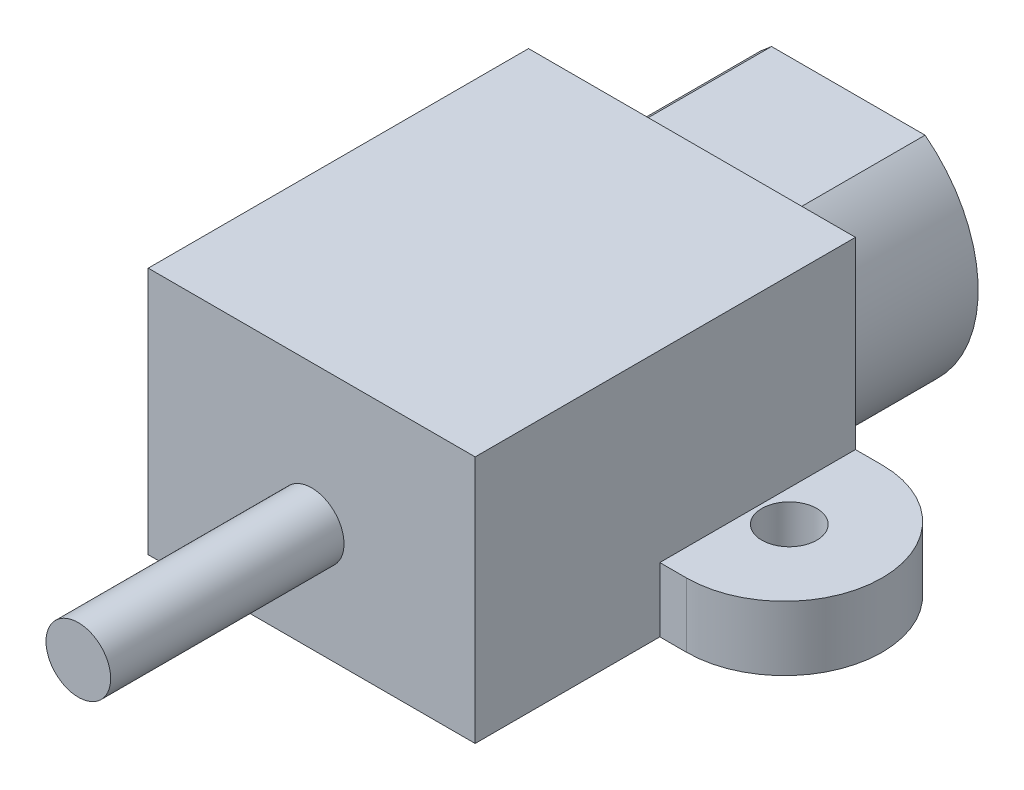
from build123d import *

# Parameters (mm, degrees)
BOSS_EXTRUDE1_DEPTH = 2.9718
SKETCH2_W           = 15.0876
SKETCH2_H           = 17.5514
BOSS_EXTRUDE2_DEPTH = 8.4836
SKETCH3_R           = 1.49225
BOSS_EXTRUDE3_DEPTH = 28.321
SKETCH4_R           = 1.27
CUT_EXTRUDE1_DEPTH  = 30.552461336
BOSS_EXTRUDE4_DEPTH = 7.2136


with BuildPart() as part:
    # Sketch1 → Boss-Extrude1 (new body)
    with BuildSketch(Plane(origin=(0, 0, 0), x_dir=(1, 0, 0), z_dir=(0, 1, 0))):
        with BuildLine():
            Line((0, 0), (15.0876, 0))
            Line((15.0876, 0), (15.0876, 8.5217))
            Line((15.0876, 8.5217), (16.3195, 8.5217))
            ThreePointArc((16.3195, 8.5217), (20.83435, 13.03655), (16.3195, 17.5514))
            Line((16.3195, 17.5514), (-1.2319, 17.5514))
            ThreePointArc((-1.2319, 17.5514), (-5.74675, 13.03655), (-1.2319, 8.5217))
            Line((-1.2319, 8.5217), (0, 8.5217))
            Line((0, 8.5217), (0, 0))
        make_face()
    extrude(amount=BOSS_EXTRUDE1_DEPTH)

    # Sketch2 → Boss-Extrude2 (add)
    with BuildSketch(Plane(origin=(0, 2.9718, 0), x_dir=(1, 0, 0), z_dir=(0, 1, 0))):
        with Locations((7.5438, 8.7757)):
            Rectangle(SKETCH2_W, SKETCH2_H)
    extrude(amount=BOSS_EXTRUDE2_DEPTH)

    # Sketch3 → Boss-Extrude3 (add)
    with BuildSketch(Plane(origin=(0, 0, -17.5514), x_dir=(-1, 0, 0), z_dir=(0, 0, -1))):
        with Locations((-7.5438, 4.953)):
            Circle(SKETCH3_R)
    extrude(amount=-BOSS_EXTRUDE3_DEPTH)

    # Sketch4 → Cut-Extrude1 (cut, through all)
    with BuildSketch(Plane.XZ):
        with Locations(Location((16.5481, -13.03655, 0), (0, 0, 270))):
            Circle(SKETCH4_R)
        with Locations(Location((-1.4605, -13.03655, 0), (0, 0, 270))):
            Circle(SKETCH4_R)
    extrude(amount=-CUT_EXTRUDE1_DEPTH, mode=Mode.SUBTRACT)

    # Sketch5 → Boss-Extrude4 (add)
    with BuildSketch(Plane(origin=(0, 0, -17.5514), x_dir=(-1, 0, 0), z_dir=(0, 0, -1))):
        with BuildLine():
            Line((-11.0871, 9.9314), (-4.0005, 9.9314))
            ThreePointArc((-4.0005, 9.9314), (-1.5494, 4.9657), (-4.0005, 0))
            Line((-4.0005, 0), (-11.0871, 0))
            ThreePointArc((-11.0871, 0), (-13.5382, 4.9657), (-11.0871, 9.9314))
        make_face()
    extrude(amount=BOSS_EXTRUDE4_DEPTH)


solid = part.part
